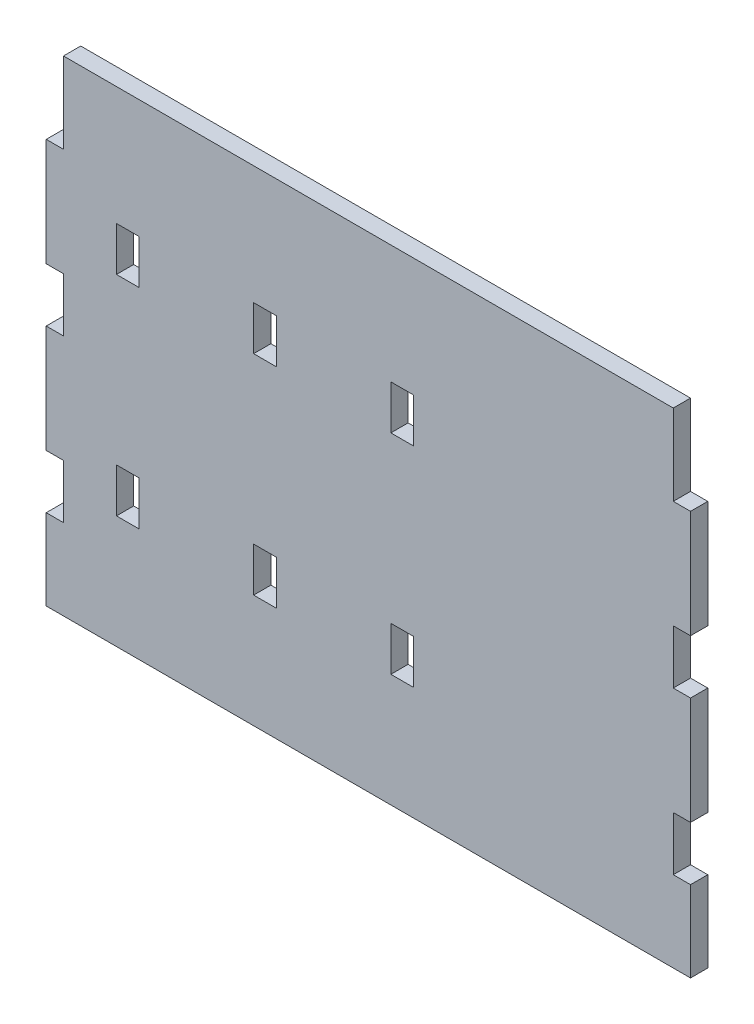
ISO-10303-21;
HEADER;
FILE_DESCRIPTION(('STEP AP214'),'2;1');
FILE_NAME('part.step','',(''),(''),'','','');
FILE_SCHEMA(('AUTOMOTIVE_DESIGN { 1 0 10303 214 1 1 1 1 }'));
ENDSEC;
DATA;
#1=APPLICATION_CONTEXT('core data for automotive mechanical design processes');
#2=APPLICATION_PROTOCOL_DEFINITION('international standard','automotive_design',2000,#1);
#3=PRODUCT_CONTEXT('',#1,'mechanical');
#4=PRODUCT('Part','Part','',(#3));
#5=PRODUCT_RELATED_PRODUCT_CATEGORY('part','',(#4));
#6=PRODUCT_DEFINITION_FORMATION('','',#4);
#7=PRODUCT_DEFINITION_CONTEXT('part definition',#1,'design');
#8=PRODUCT_DEFINITION('design','',#6,#7);
#9=PRODUCT_DEFINITION_SHAPE('','',#8);
#10=(LENGTH_UNIT() NAMED_UNIT(*) SI_UNIT(.MILLI.,.METRE.));
#11=(NAMED_UNIT(*) PLANE_ANGLE_UNIT() SI_UNIT($,.RADIAN.));
#12=(NAMED_UNIT(*) SI_UNIT($,.STERADIAN.) SOLID_ANGLE_UNIT());
#13=UNCERTAINTY_MEASURE_WITH_UNIT(LENGTH_MEASURE(1.E-05),#10,'distance_accuracy_value','');
#14=(GEOMETRIC_REPRESENTATION_CONTEXT(3) GLOBAL_UNCERTAINTY_ASSIGNED_CONTEXT((#13)) GLOBAL_UNIT_ASSIGNED_CONTEXT((#10,
#11,#12)) REPRESENTATION_CONTEXT('',''));
#15=CARTESIAN_POINT('',(0.,0.,0.));
#16=DIRECTION('',(0.,0.,1.));
#17=DIRECTION('',(1.,0.,0.));
#18=AXIS2_PLACEMENT_3D('',#15,#16,#17);
#19=CARTESIAN_POINT('',(0.,475.,16.));
#20=DIRECTION('',(0.,1.,0.));
#21=DIRECTION('',(0.,0.,1.));
#22=AXIS2_PLACEMENT_3D('',#19,#20,#21);
#23=PLANE('',#22);
#24=DIRECTION('',(1.,0.,0.));
#25=VECTOR('',#24,1.);
#26=CARTESIAN_POINT('',(0.,475.,0.));
#27=LINE('',#26,#25);
#28=CARTESIAN_POINT('',(565.8,475.,0.));
#29=VERTEX_POINT('',#28);
#30=CARTESIAN_POINT('',(581.8,475.,0.));
#31=VERTEX_POINT('',#30);
#32=EDGE_CURVE('E521',#29,#31,#27,.T.);
#33=ORIENTED_EDGE('',*,*,#32,.F.);
#34=DIRECTION('',(0.,0.,-1.));
#35=VECTOR('',#34,1.);
#36=CARTESIAN_POINT('',(565.8,475.,16.));
#37=LINE('',#36,#35);
#38=CARTESIAN_POINT('',(565.8,475.,16.));
#39=VERTEX_POINT('',#38);
#40=EDGE_CURVE('E11',#39,#29,#37,.T.);
#41=ORIENTED_EDGE('',*,*,#40,.F.);
#42=DIRECTION('',(1.,0.,0.));
#43=VECTOR('',#42,1.);
#44=CARTESIAN_POINT('',(0.,475.,16.));
#45=LINE('',#44,#43);
#46=CARTESIAN_POINT('',(581.8,475.,16.));
#47=VERTEX_POINT('',#46);
#48=EDGE_CURVE('E528',#39,#47,#45,.T.);
#49=ORIENTED_EDGE('',*,*,#48,.T.);
#50=DIRECTION('',(0.,0.,-1.));
#51=VECTOR('',#50,1.);
#52=CARTESIAN_POINT('',(581.8,475.,16.));
#53=LINE('',#52,#51);
#54=EDGE_CURVE('E583',#47,#31,#53,.T.);
#55=ORIENTED_EDGE('',*,*,#54,.T.);
#56=EDGE_LOOP('',(#33,#41,#49,#55));
#57=FACE_BOUND('',#56,.T.);
#58=ADVANCED_FACE('F36',(#57),#23,.T.);
#59=CARTESIAN_POINT('',(565.8,-1.66533453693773E-13,16.));
#60=DIRECTION('',(-1.,0.,0.));
#61=DIRECTION('',(0.,-1.,0.));
#62=AXIS2_PLACEMENT_3D('',#59,#60,#61);
#63=PLANE('',#62);
#64=DIRECTION('',(0.,1.,0.));
#65=VECTOR('',#64,1.);
#66=CARTESIAN_POINT('',(565.8,-1.66533453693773E-13,0.));
#67=LINE('',#66,#65);
#68=CARTESIAN_POINT('',(565.8,550.,0.));
#69=VERTEX_POINT('',#68);
#70=EDGE_CURVE('E586',#29,#69,#67,.T.);
#71=ORIENTED_EDGE('',*,*,#70,.T.);
#72=DIRECTION('',(0.,0.,-1.));
#73=VECTOR('',#72,1.);
#74=CARTESIAN_POINT('',(565.8,550.,16.));
#75=LINE('',#74,#73);
#76=CARTESIAN_POINT('',(565.8,550.,16.));
#77=VERTEX_POINT('',#76);
#78=EDGE_CURVE('E43',#77,#69,#75,.T.);
#79=ORIENTED_EDGE('',*,*,#78,.F.);
#80=DIRECTION('',(0.,1.,0.));
#81=VECTOR('',#80,1.);
#82=CARTESIAN_POINT('',(565.8,-1.66533453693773E-13,16.));
#83=LINE('',#82,#81);
#84=EDGE_CURVE('E531',#39,#77,#83,.T.);
#85=ORIENTED_EDGE('',*,*,#84,.F.);
#86=ORIENTED_EDGE('',*,*,#40,.T.);
#87=EDGE_LOOP('',(#71,#79,#85,#86));
#88=FACE_BOUND('',#87,.T.);
#89=ADVANCED_FACE('F698',(#88),#63,.F.);
#90=CARTESIAN_POINT('',(0.,550.,16.));
#91=DIRECTION('',(0.,1.,0.));
#92=DIRECTION('',(0.,0.,1.));
#93=AXIS2_PLACEMENT_3D('',#90,#91,#92);
#94=PLANE('',#93);
#95=DIRECTION('',(1.,0.,0.));
#96=VECTOR('',#95,1.);
#97=CARTESIAN_POINT('',(0.,550.,0.));
#98=LINE('',#97,#96);
#99=CARTESIAN_POINT('',(0.,550.,0.));
#100=VERTEX_POINT('',#99);
#101=EDGE_CURVE('E589',#100,#69,#98,.T.);
#102=ORIENTED_EDGE('',*,*,#101,.F.);
#103=DIRECTION('',(0.,0.,-1.));
#104=VECTOR('',#103,1.);
#105=CARTESIAN_POINT('',(0.,550.,16.));
#106=LINE('',#105,#104);
#107=CARTESIAN_POINT('',(0.,550.,16.));
#108=VERTEX_POINT('',#107);
#109=EDGE_CURVE('E689',#108,#100,#106,.T.);
#110=ORIENTED_EDGE('',*,*,#109,.F.);
#111=DIRECTION('',(1.,0.,0.));
#112=VECTOR('',#111,1.);
#113=CARTESIAN_POINT('',(0.,550.,16.));
#114=LINE('',#113,#112);
#115=EDGE_CURVE('E534',#108,#77,#114,.T.);
#116=ORIENTED_EDGE('',*,*,#115,.T.);
#117=ORIENTED_EDGE('',*,*,#78,.T.);
#118=EDGE_LOOP('',(#102,#110,#116,#117));
#119=FACE_BOUND('',#118,.T.);
#120=ADVANCED_FACE('F693',(#119),#94,.T.);
#121=CARTESIAN_POINT('',(0.,0.,16.));
#122=DIRECTION('',(-1.,0.,0.));
#123=DIRECTION('',(0.,-1.,0.));
#124=AXIS2_PLACEMENT_3D('',#121,#122,#123);
#125=PLANE('',#124);
#126=DIRECTION('',(0.,1.,0.));
#127=VECTOR('',#126,1.);
#128=CARTESIAN_POINT('',(0.,0.,0.));
#129=LINE('',#128,#127);
#130=CARTESIAN_POINT('',(0.,475.,0.));
#131=VERTEX_POINT('',#130);
#132=EDGE_CURVE('E594',#131,#100,#129,.T.);
#133=ORIENTED_EDGE('',*,*,#132,.F.);
#134=DIRECTION('',(0.,0.,-1.));
#135=VECTOR('',#134,1.);
#136=CARTESIAN_POINT('',(0.,475.,16.));
#137=LINE('',#136,#135);
#138=CARTESIAN_POINT('',(0.,475.,16.));
#139=VERTEX_POINT('',#138);
#140=EDGE_CURVE('E687',#139,#131,#137,.T.);
#141=ORIENTED_EDGE('',*,*,#140,.F.);
#142=DIRECTION('',(0.,1.,0.));
#143=VECTOR('',#142,1.);
#144=CARTESIAN_POINT('',(0.,0.,16.));
#145=LINE('',#144,#143);
#146=EDGE_CURVE('E539',#139,#108,#145,.T.);
#147=ORIENTED_EDGE('',*,*,#146,.T.);
#148=ORIENTED_EDGE('',*,*,#109,.T.);
#149=EDGE_LOOP('',(#133,#141,#147,#148));
#150=FACE_BOUND('',#149,.T.);
#151=ADVANCED_FACE('F705',(#150),#125,.T.);
#152=CARTESIAN_POINT('',(0.,475.,16.));
#153=DIRECTION('',(0.,-1.,0.));
#154=DIRECTION('',(0.,0.,-1.));
#155=AXIS2_PLACEMENT_3D('',#152,#153,#154);
#156=PLANE('',#155);
#157=DIRECTION('',(-1.,0.,0.));
#158=VECTOR('',#157,1.);
#159=CARTESIAN_POINT('',(0.,475.,0.));
#160=LINE('',#159,#158);
#161=CARTESIAN_POINT('',(-16.,475.,0.));
#162=VERTEX_POINT('',#161);
#163=EDGE_CURVE('E597',#131,#162,#160,.T.);
#164=ORIENTED_EDGE('',*,*,#163,.T.);
#165=DIRECTION('',(0.,0.,-1.));
#166=VECTOR('',#165,1.);
#167=CARTESIAN_POINT('',(-16.,475.,16.));
#168=LINE('',#167,#166);
#169=CARTESIAN_POINT('',(-16.,475.,16.));
#170=VERTEX_POINT('',#169);
#171=EDGE_CURVE('E685',#170,#162,#168,.T.);
#172=ORIENTED_EDGE('',*,*,#171,.F.);
#173=DIRECTION('',(-1.,0.,0.));
#174=VECTOR('',#173,1.);
#175=CARTESIAN_POINT('',(0.,475.,16.));
#176=LINE('',#175,#174);
#177=EDGE_CURVE('E542',#139,#170,#176,.T.);
#178=ORIENTED_EDGE('',*,*,#177,.F.);
#179=ORIENTED_EDGE('',*,*,#140,.T.);
#180=EDGE_LOOP('',(#164,#172,#178,#179));
#181=FACE_BOUND('',#180,.T.);
#182=ADVANCED_FACE('F789',(#181),#156,.F.);
#183=CARTESIAN_POINT('',(-16.,0.,16.));
#184=DIRECTION('',(-1.,0.,0.));
#185=DIRECTION('',(0.,0.,1.));
#186=AXIS2_PLACEMENT_3D('',#183,#184,#185);
#187=PLANE('',#186);
#188=DIRECTION('',(0.,1.,0.));
#189=VECTOR('',#188,1.);
#190=CARTESIAN_POINT('',(-16.,0.,0.));
#191=LINE('',#190,#189);
#192=CARTESIAN_POINT('',(-16.,375.,0.));
#193=VERTEX_POINT('',#192);
#194=EDGE_CURVE('E602',#193,#162,#191,.T.);
#195=ORIENTED_EDGE('',*,*,#194,.F.);
#196=DIRECTION('',(0.,0.,-1.));
#197=VECTOR('',#196,1.);
#198=CARTESIAN_POINT('',(-16.,375.,16.));
#199=LINE('',#198,#197);
#200=CARTESIAN_POINT('',(-16.,375.,16.));
#201=VERTEX_POINT('',#200);
#202=EDGE_CURVE('E683',#201,#193,#199,.T.);
#203=ORIENTED_EDGE('',*,*,#202,.F.);
#204=DIRECTION('',(0.,1.,0.));
#205=VECTOR('',#204,1.);
#206=CARTESIAN_POINT('',(-16.,0.,16.));
#207=LINE('',#206,#205);
#208=EDGE_CURVE('E546',#201,#170,#207,.T.);
#209=ORIENTED_EDGE('',*,*,#208,.T.);
#210=ORIENTED_EDGE('',*,*,#171,.T.);
#211=EDGE_LOOP('',(#195,#203,#209,#210));
#212=FACE_BOUND('',#211,.T.);
#213=ADVANCED_FACE('F786',(#212),#187,.T.);
#214=CARTESIAN_POINT('',(0.,375.,16.));
#215=DIRECTION('',(0.,-1.,0.));
#216=DIRECTION('',(0.,0.,-1.));
#217=AXIS2_PLACEMENT_3D('',#214,#215,#216);
#218=PLANE('',#217);
#219=DIRECTION('',(-1.,0.,0.));
#220=VECTOR('',#219,1.);
#221=CARTESIAN_POINT('',(0.,375.,0.));
#222=LINE('',#221,#220);
#223=CARTESIAN_POINT('',(0.,375.,0.));
#224=VERTEX_POINT('',#223);
#225=EDGE_CURVE('E605',#224,#193,#222,.T.);
#226=ORIENTED_EDGE('',*,*,#225,.F.);
#227=DIRECTION('',(0.,0.,-1.));
#228=VECTOR('',#227,1.);
#229=CARTESIAN_POINT('',(0.,375.,16.));
#230=LINE('',#229,#228);
#231=CARTESIAN_POINT('',(0.,375.,16.));
#232=VERTEX_POINT('',#231);
#233=EDGE_CURVE('E681',#232,#224,#230,.T.);
#234=ORIENTED_EDGE('',*,*,#233,.F.);
#235=DIRECTION('',(-1.,0.,0.));
#236=VECTOR('',#235,1.);
#237=CARTESIAN_POINT('',(0.,375.,16.));
#238=LINE('',#237,#236);
#239=EDGE_CURVE('E549',#232,#201,#238,.T.);
#240=ORIENTED_EDGE('',*,*,#239,.T.);
#241=ORIENTED_EDGE('',*,*,#202,.T.);
#242=EDGE_LOOP('',(#226,#234,#240,#241));
#243=FACE_BOUND('',#242,.T.);
#244=ADVANCED_FACE('F782',(#243),#218,.T.);
#245=CARTESIAN_POINT('',(0.,325.,0.));
#246=VERTEX_POINT('',#245);
#247=EDGE_CURVE('E599',#246,#224,#129,.T.);
#248=ORIENTED_EDGE('',*,*,#247,.F.);
#249=DIRECTION('',(0.,0.,-1.));
#250=VECTOR('',#249,1.);
#251=CARTESIAN_POINT('',(0.,325.,16.));
#252=LINE('',#251,#250);
#253=CARTESIAN_POINT('',(0.,325.,16.));
#254=VERTEX_POINT('',#253);
#255=EDGE_CURVE('E679',#254,#246,#252,.T.);
#256=ORIENTED_EDGE('',*,*,#255,.F.);
#257=EDGE_CURVE('E544',#254,#232,#145,.T.);
#258=ORIENTED_EDGE('',*,*,#257,.T.);
#259=ORIENTED_EDGE('',*,*,#233,.T.);
#260=EDGE_LOOP('',(#248,#256,#258,#259));
#261=FACE_BOUND('',#260,.T.);
#262=ADVANCED_FACE('F776',(#261),#125,.T.);
#263=CARTESIAN_POINT('',(0.,325.,16.));
#264=DIRECTION('',(0.,-1.,0.));
#265=DIRECTION('',(0.,0.,-1.));
#266=AXIS2_PLACEMENT_3D('',#263,#264,#265);
#267=PLANE('',#266);
#268=DIRECTION('',(-1.,0.,0.));
#269=VECTOR('',#268,1.);
#270=CARTESIAN_POINT('',(0.,325.,0.));
#271=LINE('',#270,#269);
#272=CARTESIAN_POINT('',(-16.,325.,0.));
#273=VERTEX_POINT('',#272);
#274=EDGE_CURVE('E608',#246,#273,#271,.T.);
#275=ORIENTED_EDGE('',*,*,#274,.T.);
#276=DIRECTION('',(0.,0.,-1.));
#277=VECTOR('',#276,1.);
#278=CARTESIAN_POINT('',(-16.,325.,16.));
#279=LINE('',#278,#277);
#280=CARTESIAN_POINT('',(-16.,325.,16.));
#281=VERTEX_POINT('',#280);
#282=EDGE_CURVE('E677',#281,#273,#279,.T.);
#283=ORIENTED_EDGE('',*,*,#282,.F.);
#284=DIRECTION('',(-1.,0.,0.));
#285=VECTOR('',#284,1.);
#286=CARTESIAN_POINT('',(0.,325.,16.));
#287=LINE('',#286,#285);
#288=EDGE_CURVE('E552',#254,#281,#287,.T.);
#289=ORIENTED_EDGE('',*,*,#288,.F.);
#290=ORIENTED_EDGE('',*,*,#255,.T.);
#291=EDGE_LOOP('',(#275,#283,#289,#290));
#292=FACE_BOUND('',#291,.T.);
#293=ADVANCED_FACE('F800',(#292),#267,.F.);
#294=CARTESIAN_POINT('',(-16.,0.,16.));
#295=DIRECTION('',(-1.,0.,0.));
#296=DIRECTION('',(0.,0.,1.));
#297=AXIS2_PLACEMENT_3D('',#294,#295,#296);
#298=PLANE('',#297);
#299=DIRECTION('',(0.,1.,0.));
#300=VECTOR('',#299,1.);
#301=CARTESIAN_POINT('',(-16.,0.,0.));
#302=LINE('',#301,#300);
#303=CARTESIAN_POINT('',(-16.,225.,0.));
#304=VERTEX_POINT('',#303);
#305=EDGE_CURVE('E611',#304,#273,#302,.T.);
#306=ORIENTED_EDGE('',*,*,#305,.F.);
#307=DIRECTION('',(0.,0.,-1.));
#308=VECTOR('',#307,1.);
#309=CARTESIAN_POINT('',(-16.,225.,16.));
#310=LINE('',#309,#308);
#311=CARTESIAN_POINT('',(-16.,225.,16.));
#312=VERTEX_POINT('',#311);
#313=EDGE_CURVE('E675',#312,#304,#310,.T.);
#314=ORIENTED_EDGE('',*,*,#313,.F.);
#315=DIRECTION('',(0.,1.,0.));
#316=VECTOR('',#315,1.);
#317=CARTESIAN_POINT('',(-16.,0.,16.));
#318=LINE('',#317,#316);
#319=EDGE_CURVE('E554',#312,#281,#318,.T.);
#320=ORIENTED_EDGE('',*,*,#319,.T.);
#321=ORIENTED_EDGE('',*,*,#282,.T.);
#322=EDGE_LOOP('',(#306,#314,#320,#321));
#323=FACE_BOUND('',#322,.T.);
#324=ADVANCED_FACE('F798',(#323),#298,.T.);
#325=CARTESIAN_POINT('',(0.,225.,16.));
#326=DIRECTION('',(0.,-1.,0.));
#327=DIRECTION('',(0.,0.,-1.));
#328=AXIS2_PLACEMENT_3D('',#325,#326,#327);
#329=PLANE('',#328);
#330=DIRECTION('',(-1.,0.,0.));
#331=VECTOR('',#330,1.);
#332=CARTESIAN_POINT('',(0.,225.,0.));
#333=LINE('',#332,#331);
#334=CARTESIAN_POINT('',(0.,225.,0.));
#335=VERTEX_POINT('',#334);
#336=EDGE_CURVE('E614',#335,#304,#333,.T.);
#337=ORIENTED_EDGE('',*,*,#336,.F.);
#338=DIRECTION('',(0.,0.,-1.));
#339=VECTOR('',#338,1.);
#340=CARTESIAN_POINT('',(0.,225.,16.));
#341=LINE('',#340,#339);
#342=CARTESIAN_POINT('',(0.,225.,16.));
#343=VERTEX_POINT('',#342);
#344=EDGE_CURVE('E673',#343,#335,#341,.T.);
#345=ORIENTED_EDGE('',*,*,#344,.F.);
#346=DIRECTION('',(-1.,0.,0.));
#347=VECTOR('',#346,1.);
#348=CARTESIAN_POINT('',(0.,225.,16.));
#349=LINE('',#348,#347);
#350=EDGE_CURVE('E557',#343,#312,#349,.T.);
#351=ORIENTED_EDGE('',*,*,#350,.T.);
#352=ORIENTED_EDGE('',*,*,#313,.T.);
#353=EDGE_LOOP('',(#337,#345,#351,#352));
#354=FACE_BOUND('',#353,.T.);
#355=ADVANCED_FACE('F795',(#354),#329,.T.);
#356=CARTESIAN_POINT('',(0.,175.,0.));
#357=VERTEX_POINT('',#356);
#358=EDGE_CURVE('E598',#357,#335,#129,.T.);
#359=ORIENTED_EDGE('',*,*,#358,.F.);
#360=DIRECTION('',(0.,0.,-1.));
#361=VECTOR('',#360,1.);
#362=CARTESIAN_POINT('',(0.,175.,16.));
#363=LINE('',#362,#361);
#364=CARTESIAN_POINT('',(0.,175.,16.));
#365=VERTEX_POINT('',#364);
#366=EDGE_CURVE('E671',#365,#357,#363,.T.);
#367=ORIENTED_EDGE('',*,*,#366,.F.);
#368=EDGE_CURVE('E543',#365,#343,#145,.T.);
#369=ORIENTED_EDGE('',*,*,#368,.T.);
#370=ORIENTED_EDGE('',*,*,#344,.T.);
#371=EDGE_LOOP('',(#359,#367,#369,#370));
#372=FACE_BOUND('',#371,.T.);
#373=ADVANCED_FACE('F767',(#372),#125,.T.);
#374=CARTESIAN_POINT('',(0.,175.,16.));
#375=DIRECTION('',(0.,-1.,0.));
#376=DIRECTION('',(0.,0.,-1.));
#377=AXIS2_PLACEMENT_3D('',#374,#375,#376);
#378=PLANE('',#377);
#379=DIRECTION('',(-1.,0.,0.));
#380=VECTOR('',#379,1.);
#381=CARTESIAN_POINT('',(0.,175.,0.));
#382=LINE('',#381,#380);
#383=CARTESIAN_POINT('',(-16.,175.,0.));
#384=VERTEX_POINT('',#383);
#385=EDGE_CURVE('E617',#357,#384,#382,.T.);
#386=ORIENTED_EDGE('',*,*,#385,.T.);
#387=DIRECTION('',(0.,0.,-1.));
#388=VECTOR('',#387,1.);
#389=CARTESIAN_POINT('',(-16.,175.,16.));
#390=LINE('',#389,#388);
#391=CARTESIAN_POINT('',(-16.,175.,16.));
#392=VERTEX_POINT('',#391);
#393=EDGE_CURVE('E668',#392,#384,#390,.T.);
#394=ORIENTED_EDGE('',*,*,#393,.F.);
#395=DIRECTION('',(-1.,0.,0.));
#396=VECTOR('',#395,1.);
#397=CARTESIAN_POINT('',(0.,175.,16.));
#398=LINE('',#397,#396);
#399=EDGE_CURVE('E560',#365,#392,#398,.T.);
#400=ORIENTED_EDGE('',*,*,#399,.F.);
#401=ORIENTED_EDGE('',*,*,#366,.T.);
#402=EDGE_LOOP('',(#386,#394,#400,#401));
#403=FACE_BOUND('',#402,.T.);
#404=ADVANCED_FACE('F843',(#403),#378,.F.);
#405=CARTESIAN_POINT('',(-16.,0.,16.));
#406=DIRECTION('',(1.,0.,0.));
#407=DIRECTION('',(0.,0.,-1.));
#408=AXIS2_PLACEMENT_3D('',#405,#406,#407);
#409=PLANE('',#408);
#410=DIRECTION('',(0.,-1.,0.));
#411=VECTOR('',#410,1.);
#412=CARTESIAN_POINT('',(-16.,0.,0.));
#413=LINE('',#412,#411);
#414=CARTESIAN_POINT('',(-16.,100.,0.));
#415=VERTEX_POINT('',#414);
#416=EDGE_CURVE('E619',#384,#415,#413,.T.);
#417=ORIENTED_EDGE('',*,*,#416,.T.);
#418=DIRECTION('',(0.,0.,-1.));
#419=VECTOR('',#418,1.);
#420=CARTESIAN_POINT('',(-16.,100.,16.));
#421=LINE('',#420,#419);
#422=CARTESIAN_POINT('',(-16.,100.,16.));
#423=VERTEX_POINT('',#422);
#424=EDGE_CURVE('E665',#423,#415,#421,.T.);
#425=ORIENTED_EDGE('',*,*,#424,.F.);
#426=DIRECTION('',(0.,-1.,0.));
#427=VECTOR('',#426,1.);
#428=CARTESIAN_POINT('',(-16.,0.,16.));
#429=LINE('',#428,#427);
#430=EDGE_CURVE('E562',#392,#423,#429,.T.);
#431=ORIENTED_EDGE('',*,*,#430,.F.);
#432=ORIENTED_EDGE('',*,*,#393,.T.);
#433=EDGE_LOOP('',(#417,#425,#431,#432));
#434=FACE_BOUND('',#433,.T.);
#435=ADVANCED_FACE('F760',(#434),#409,.F.);
#436=CARTESIAN_POINT('',(0.,100.,16.));
#437=DIRECTION('',(0.,1.,0.));
#438=DIRECTION('',(0.,0.,1.));
#439=AXIS2_PLACEMENT_3D('',#436,#437,#438);
#440=PLANE('',#439);
#441=DIRECTION('',(1.,0.,0.));
#442=VECTOR('',#441,1.);
#443=CARTESIAN_POINT('',(0.,100.,0.));
#444=LINE('',#443,#442);
#445=CARTESIAN_POINT('',(581.8,100.,0.));
#446=VERTEX_POINT('',#445);
#447=EDGE_CURVE('E621',#415,#446,#444,.T.);
#448=ORIENTED_EDGE('',*,*,#447,.T.);
#449=DIRECTION('',(0.,0.,-1.));
#450=VECTOR('',#449,1.);
#451=CARTESIAN_POINT('',(581.8,100.,16.));
#452=LINE('',#451,#450);
#453=CARTESIAN_POINT('',(581.8,100.,16.));
#454=VERTEX_POINT('',#453);
#455=EDGE_CURVE('E663',#454,#446,#452,.T.);
#456=ORIENTED_EDGE('',*,*,#455,.F.);
#457=DIRECTION('',(1.,0.,0.));
#458=VECTOR('',#457,1.);
#459=CARTESIAN_POINT('',(0.,100.,16.));
#460=LINE('',#459,#458);
#461=EDGE_CURVE('E564',#423,#454,#460,.T.);
#462=ORIENTED_EDGE('',*,*,#461,.F.);
#463=ORIENTED_EDGE('',*,*,#424,.T.);
#464=EDGE_LOOP('',(#448,#456,#462,#463));
#465=FACE_BOUND('',#464,.T.);
#466=ADVANCED_FACE('F756',(#465),#440,.F.);
#467=CARTESIAN_POINT('',(581.8,-8.88178419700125E-13,16.));
#468=DIRECTION('',(1.,0.,0.));
#469=DIRECTION('',(0.,1.,0.));
#470=AXIS2_PLACEMENT_3D('',#467,#468,#469);
#471=PLANE('',#470);
#472=DIRECTION('',(0.,-1.,0.));
#473=VECTOR('',#472,1.);
#474=CARTESIAN_POINT('',(581.8,-8.88178419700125E-13,0.));
#475=LINE('',#474,#473);
#476=CARTESIAN_POINT('',(581.8,175.,0.));
#477=VERTEX_POINT('',#476);
#478=EDGE_CURVE('E624',#477,#446,#475,.T.);
#479=ORIENTED_EDGE('',*,*,#478,.F.);
#480=DIRECTION('',(0.,0.,-1.));
#481=VECTOR('',#480,1.);
#482=CARTESIAN_POINT('',(581.8,175.,16.));
#483=LINE('',#482,#481);
#484=CARTESIAN_POINT('',(581.8,175.,16.));
#485=VERTEX_POINT('',#484);
#486=EDGE_CURVE('E661',#485,#477,#483,.T.);
#487=ORIENTED_EDGE('',*,*,#486,.F.);
#488=DIRECTION('',(0.,-1.,0.));
#489=VECTOR('',#488,1.);
#490=CARTESIAN_POINT('',(581.8,-8.88178419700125E-13,16.));
#491=LINE('',#490,#489);
#492=EDGE_CURVE('E566',#485,#454,#491,.T.);
#493=ORIENTED_EDGE('',*,*,#492,.T.);
#494=ORIENTED_EDGE('',*,*,#455,.T.);
#495=EDGE_LOOP('',(#479,#487,#493,#494));
#496=FACE_BOUND('',#495,.T.);
#497=ADVANCED_FACE('F752',(#496),#471,.T.);
#498=CARTESIAN_POINT('',(0.,175.,16.));
#499=DIRECTION('',(0.,1.,0.));
#500=DIRECTION('',(0.,0.,1.));
#501=AXIS2_PLACEMENT_3D('',#498,#499,#500);
#502=PLANE('',#501);
#503=DIRECTION('',(1.,0.,0.));
#504=VECTOR('',#503,1.);
#505=CARTESIAN_POINT('',(0.,175.,0.));
#506=LINE('',#505,#504);
#507=CARTESIAN_POINT('',(565.8,175.,0.));
#508=VERTEX_POINT('',#507);
#509=EDGE_CURVE('E627',#508,#477,#506,.T.);
#510=ORIENTED_EDGE('',*,*,#509,.F.);
#511=DIRECTION('',(0.,0.,-1.));
#512=VECTOR('',#511,1.);
#513=CARTESIAN_POINT('',(565.8,175.,16.));
#514=LINE('',#513,#512);
#515=CARTESIAN_POINT('',(565.8,175.,16.));
#516=VERTEX_POINT('',#515);
#517=EDGE_CURVE('E659',#516,#508,#514,.T.);
#518=ORIENTED_EDGE('',*,*,#517,.F.);
#519=DIRECTION('',(1.,0.,0.));
#520=VECTOR('',#519,1.);
#521=CARTESIAN_POINT('',(0.,175.,16.));
#522=LINE('',#521,#520);
#523=EDGE_CURVE('E569',#516,#485,#522,.T.);
#524=ORIENTED_EDGE('',*,*,#523,.T.);
#525=ORIENTED_EDGE('',*,*,#486,.T.);
#526=EDGE_LOOP('',(#510,#518,#524,#525));
#527=FACE_BOUND('',#526,.T.);
#528=ADVANCED_FACE('F747',(#527),#502,.T.);
#529=CARTESIAN_POINT('',(565.8,225.,0.));
#530=VERTEX_POINT('',#529);
#531=EDGE_CURVE('E591',#508,#530,#67,.T.);
#532=ORIENTED_EDGE('',*,*,#531,.T.);
#533=DIRECTION('',(0.,0.,-1.));
#534=VECTOR('',#533,1.);
#535=CARTESIAN_POINT('',(565.8,225.,16.));
#536=LINE('',#535,#534);
#537=CARTESIAN_POINT('',(565.8,225.,16.));
#538=VERTEX_POINT('',#537);
#539=EDGE_CURVE('E656',#538,#530,#536,.T.);
#540=ORIENTED_EDGE('',*,*,#539,.F.);
#541=EDGE_CURVE('E536',#516,#538,#83,.T.);
#542=ORIENTED_EDGE('',*,*,#541,.F.);
#543=ORIENTED_EDGE('',*,*,#517,.T.);
#544=EDGE_LOOP('',(#532,#540,#542,#543));
#545=FACE_BOUND('',#544,.T.);
#546=ADVANCED_FACE('F731',(#545),#63,.F.);
#547=CARTESIAN_POINT('',(0.,225.,16.));
#548=DIRECTION('',(0.,1.,0.));
#549=DIRECTION('',(0.,0.,1.));
#550=AXIS2_PLACEMENT_3D('',#547,#548,#549);
#551=PLANE('',#550);
#552=DIRECTION('',(1.,0.,0.));
#553=VECTOR('',#552,1.);
#554=CARTESIAN_POINT('',(0.,225.,0.));
#555=LINE('',#554,#553);
#556=CARTESIAN_POINT('',(581.8,225.,0.));
#557=VERTEX_POINT('',#556);
#558=EDGE_CURVE('E630',#530,#557,#555,.T.);
#559=ORIENTED_EDGE('',*,*,#558,.T.);
#560=DIRECTION('',(0.,0.,-1.));
#561=VECTOR('',#560,1.);
#562=CARTESIAN_POINT('',(581.8,225.,16.));
#563=LINE('',#562,#561);
#564=CARTESIAN_POINT('',(581.8,225.,16.));
#565=VERTEX_POINT('',#564);
#566=EDGE_CURVE('E653',#565,#557,#563,.T.);
#567=ORIENTED_EDGE('',*,*,#566,.F.);
#568=DIRECTION('',(1.,0.,0.));
#569=VECTOR('',#568,1.);
#570=CARTESIAN_POINT('',(0.,225.,16.));
#571=LINE('',#570,#569);
#572=EDGE_CURVE('E572',#538,#565,#571,.T.);
#573=ORIENTED_EDGE('',*,*,#572,.F.);
#574=ORIENTED_EDGE('',*,*,#539,.T.);
#575=EDGE_LOOP('',(#559,#567,#573,#574));
#576=FACE_BOUND('',#575,.T.);
#577=ADVANCED_FACE('F737',(#576),#551,.F.);
#578=CARTESIAN_POINT('',(581.8,0.,16.));
#579=DIRECTION('',(-1.,0.,0.));
#580=DIRECTION('',(0.,0.,1.));
#581=AXIS2_PLACEMENT_3D('',#578,#579,#580);
#582=PLANE('',#581);
#583=DIRECTION('',(0.,1.,0.));
#584=VECTOR('',#583,1.);
#585=CARTESIAN_POINT('',(581.8,0.,0.));
#586=LINE('',#585,#584);
#587=CARTESIAN_POINT('',(581.8,325.,0.));
#588=VERTEX_POINT('',#587);
#589=EDGE_CURVE('E632',#557,#588,#586,.T.);
#590=ORIENTED_EDGE('',*,*,#589,.T.);
#591=DIRECTION('',(0.,0.,-1.));
#592=VECTOR('',#591,1.);
#593=CARTESIAN_POINT('',(581.8,325.,16.));
#594=LINE('',#593,#592);
#595=CARTESIAN_POINT('',(581.8,325.,16.));
#596=VERTEX_POINT('',#595);
#597=EDGE_CURVE('E651',#596,#588,#594,.T.);
#598=ORIENTED_EDGE('',*,*,#597,.F.);
#599=DIRECTION('',(0.,1.,0.));
#600=VECTOR('',#599,1.);
#601=CARTESIAN_POINT('',(581.8,0.,16.));
#602=LINE('',#601,#600);
#603=EDGE_CURVE('E574',#565,#596,#602,.T.);
#604=ORIENTED_EDGE('',*,*,#603,.F.);
#605=ORIENTED_EDGE('',*,*,#566,.T.);
#606=EDGE_LOOP('',(#590,#598,#604,#605));
#607=FACE_BOUND('',#606,.T.);
#608=ADVANCED_FACE('F742',(#607),#582,.F.);
#609=CARTESIAN_POINT('',(0.,325.,16.));
#610=DIRECTION('',(0.,1.,0.));
#611=DIRECTION('',(0.,0.,1.));
#612=AXIS2_PLACEMENT_3D('',#609,#610,#611);
#613=PLANE('',#612);
#614=DIRECTION('',(1.,0.,0.));
#615=VECTOR('',#614,1.);
#616=CARTESIAN_POINT('',(0.,325.,0.));
#617=LINE('',#616,#615);
#618=CARTESIAN_POINT('',(565.8,325.,0.));
#619=VERTEX_POINT('',#618);
#620=EDGE_CURVE('E635',#619,#588,#617,.T.);
#621=ORIENTED_EDGE('',*,*,#620,.F.);
#622=DIRECTION('',(0.,0.,-1.));
#623=VECTOR('',#622,1.);
#624=CARTESIAN_POINT('',(565.8,325.,16.));
#625=LINE('',#624,#623);
#626=CARTESIAN_POINT('',(565.8,325.,16.));
#627=VERTEX_POINT('',#626);
#628=EDGE_CURVE('E649',#627,#619,#625,.T.);
#629=ORIENTED_EDGE('',*,*,#628,.F.);
#630=DIRECTION('',(1.,0.,0.));
#631=VECTOR('',#630,1.);
#632=CARTESIAN_POINT('',(0.,325.,16.));
#633=LINE('',#632,#631);
#634=EDGE_CURVE('E576',#627,#596,#633,.T.);
#635=ORIENTED_EDGE('',*,*,#634,.T.);
#636=ORIENTED_EDGE('',*,*,#597,.T.);
#637=EDGE_LOOP('',(#621,#629,#635,#636));
#638=FACE_BOUND('',#637,.T.);
#639=ADVANCED_FACE('F822',(#638),#613,.T.);
#640=CARTESIAN_POINT('',(565.8,375.,0.));
#641=VERTEX_POINT('',#640);
#642=EDGE_CURVE('E590',#619,#641,#67,.T.);
#643=ORIENTED_EDGE('',*,*,#642,.T.);
#644=DIRECTION('',(0.,0.,-1.));
#645=VECTOR('',#644,1.);
#646=CARTESIAN_POINT('',(565.8,375.,16.));
#647=LINE('',#646,#645);
#648=CARTESIAN_POINT('',(565.8,375.,16.));
#649=VERTEX_POINT('',#648);
#650=EDGE_CURVE('E646',#649,#641,#647,.T.);
#651=ORIENTED_EDGE('',*,*,#650,.F.);
#652=EDGE_CURVE('E535',#627,#649,#83,.T.);
#653=ORIENTED_EDGE('',*,*,#652,.F.);
#654=ORIENTED_EDGE('',*,*,#628,.T.);
#655=EDGE_LOOP('',(#643,#651,#653,#654));
#656=FACE_BOUND('',#655,.T.);
#657=ADVANCED_FACE('F725',(#656),#63,.F.);
#658=CARTESIAN_POINT('',(0.,375.,16.));
#659=DIRECTION('',(0.,1.,0.));
#660=DIRECTION('',(0.,0.,1.));
#661=AXIS2_PLACEMENT_3D('',#658,#659,#660);
#662=PLANE('',#661);
#663=DIRECTION('',(1.,0.,0.));
#664=VECTOR('',#663,1.);
#665=CARTESIAN_POINT('',(0.,375.,0.));
#666=LINE('',#665,#664);
#667=CARTESIAN_POINT('',(581.8,375.,0.));
#668=VERTEX_POINT('',#667);
#669=EDGE_CURVE('E638',#641,#668,#666,.T.);
#670=ORIENTED_EDGE('',*,*,#669,.T.);
#671=DIRECTION('',(0.,0.,-1.));
#672=VECTOR('',#671,1.);
#673=CARTESIAN_POINT('',(581.8,375.,16.));
#674=LINE('',#673,#672);
#675=CARTESIAN_POINT('',(581.8,375.,16.));
#676=VERTEX_POINT('',#675);
#677=EDGE_CURVE('E643',#676,#668,#674,.T.);
#678=ORIENTED_EDGE('',*,*,#677,.F.);
#679=DIRECTION('',(1.,0.,0.));
#680=VECTOR('',#679,1.);
#681=CARTESIAN_POINT('',(0.,375.,16.));
#682=LINE('',#681,#680);
#683=EDGE_CURVE('E579',#649,#676,#682,.T.);
#684=ORIENTED_EDGE('',*,*,#683,.F.);
#685=ORIENTED_EDGE('',*,*,#650,.T.);
#686=EDGE_LOOP('',(#670,#678,#684,#685));
#687=FACE_BOUND('',#686,.T.);
#688=ADVANCED_FACE('F721',(#687),#662,.F.);
#689=CARTESIAN_POINT('',(581.8,0.,16.));
#690=DIRECTION('',(-1.,0.,0.));
#691=DIRECTION('',(0.,0.,1.));
#692=AXIS2_PLACEMENT_3D('',#689,#690,#691);
#693=PLANE('',#692);
#694=DIRECTION('',(0.,1.,0.));
#695=VECTOR('',#694,1.);
#696=CARTESIAN_POINT('',(581.8,0.,0.));
#697=LINE('',#696,#695);
#698=EDGE_CURVE('E532',#668,#31,#697,.T.);
#699=ORIENTED_EDGE('',*,*,#698,.T.);
#700=ORIENTED_EDGE('',*,*,#54,.F.);
#701=DIRECTION('',(0.,1.,0.));
#702=VECTOR('',#701,1.);
#703=CARTESIAN_POINT('',(581.8,0.,16.));
#704=LINE('',#703,#702);
#705=EDGE_CURVE('E581',#676,#47,#704,.T.);
#706=ORIENTED_EDGE('',*,*,#705,.F.);
#707=ORIENTED_EDGE('',*,*,#677,.T.);
#708=EDGE_LOOP('',(#699,#700,#706,#707));
#709=FACE_BOUND('',#708,.T.);
#710=ADVANCED_FACE('F717',(#709),#693,.F.);
#711=CARTESIAN_POINT('',(0.,0.,16.));
#712=DIRECTION('',(0.,0.,1.));
#713=DIRECTION('',(1.,0.,0.));
#714=AXIS2_PLACEMENT_3D('',#711,#712,#713);
#715=PLANE('',#714);
#716=DIRECTION('',(1.,0.,0.));
#717=VECTOR('',#716,1.);
#718=CARTESIAN_POINT('',(0.,399.,16.));
#719=LINE('',#718,#717);
#720=CARTESIAN_POINT('',(176.45,399.,16.));
#721=VERTEX_POINT('',#720);
#722=CARTESIAN_POINT('',(197.45,399.,16.));
#723=VERTEX_POINT('',#722);
#724=EDGE_CURVE('E50',#721,#723,#719,.T.);
#725=ORIENTED_EDGE('',*,*,#724,.F.);
#726=DIRECTION('',(0.,1.,0.));
#727=VECTOR('',#726,1.);
#728=CARTESIAN_POINT('',(176.45,0.,16.));
#729=LINE('',#728,#727);
#730=CARTESIAN_POINT('',(176.45,440.,16.));
#731=VERTEX_POINT('',#730);
#732=EDGE_CURVE('E347',#721,#731,#729,.T.);
#733=ORIENTED_EDGE('',*,*,#732,.T.);
#734=DIRECTION('',(1.,0.,0.));
#735=VECTOR('',#734,1.);
#736=CARTESIAN_POINT('',(0.,440.,16.));
#737=LINE('',#736,#735);
#738=CARTESIAN_POINT('',(197.45,440.,16.));
#739=VERTEX_POINT('',#738);
#740=EDGE_CURVE('E353',#731,#739,#737,.T.);
#741=ORIENTED_EDGE('',*,*,#740,.T.);
#742=DIRECTION('',(0.,1.,0.));
#743=VECTOR('',#742,1.);
#744=CARTESIAN_POINT('',(197.45,0.,16.));
#745=LINE('',#744,#743);
#746=EDGE_CURVE('E359',#723,#739,#745,.T.);
#747=ORIENTED_EDGE('',*,*,#746,.F.);
#748=EDGE_LOOP('',(#725,#733,#741,#747));
#749=FACE_BOUND('',#748,.T.);
#750=DIRECTION('',(1.,0.,0.));
#751=VECTOR('',#750,1.);
#752=CARTESIAN_POINT('',(0.,399.,16.));
#753=LINE('',#752,#751);
#754=CARTESIAN_POINT('',(303.75,399.,16.));
#755=VERTEX_POINT('',#754);
#756=CARTESIAN_POINT('',(324.75,399.,16.));
#757=VERTEX_POINT('',#756);
#758=EDGE_CURVE('E58',#755,#757,#753,.T.);
#759=ORIENTED_EDGE('',*,*,#758,.F.);
#760=DIRECTION('',(0.,1.,0.));
#761=VECTOR('',#760,1.);
#762=CARTESIAN_POINT('',(303.75,0.,16.));
#763=LINE('',#762,#761);
#764=CARTESIAN_POINT('',(303.75,440.,16.));
#765=VERTEX_POINT('',#764);
#766=EDGE_CURVE('E387',#755,#765,#763,.T.);
#767=ORIENTED_EDGE('',*,*,#766,.T.);
#768=DIRECTION('',(1.,0.,0.));
#769=VECTOR('',#768,1.);
#770=CARTESIAN_POINT('',(0.,440.,16.));
#771=LINE('',#770,#769);
#772=CARTESIAN_POINT('',(324.75,440.,16.));
#773=VERTEX_POINT('',#772);
#774=EDGE_CURVE('E390',#765,#773,#771,.T.);
#775=ORIENTED_EDGE('',*,*,#774,.T.);
#776=DIRECTION('',(0.,1.,0.));
#777=VECTOR('',#776,1.);
#778=CARTESIAN_POINT('',(324.75,0.,16.));
#779=LINE('',#778,#777);
#780=EDGE_CURVE('E394',#757,#773,#779,.T.);
#781=ORIENTED_EDGE('',*,*,#780,.F.);
#782=EDGE_LOOP('',(#759,#767,#775,#781));
#783=FACE_BOUND('',#782,.T.);
#784=DIRECTION('',(1.,0.,0.));
#785=VECTOR('',#784,1.);
#786=CARTESIAN_POINT('',(49.1500000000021,205.,16.));
#787=LINE('',#786,#785);
#788=CARTESIAN_POINT('',(49.1500000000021,205.,16.));
#789=VERTEX_POINT('',#788);
#790=CARTESIAN_POINT('',(70.150000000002,205.,16.));
#791=VERTEX_POINT('',#790);
#792=EDGE_CURVE('E417',#789,#791,#787,.T.);
#793=ORIENTED_EDGE('',*,*,#792,.F.);
#794=DIRECTION('',(0.,1.,0.));
#795=VECTOR('',#794,1.);
#796=CARTESIAN_POINT('',(49.1500000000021,205.,16.));
#797=LINE('',#796,#795);
#798=CARTESIAN_POINT('',(49.1500000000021,246.,16.));
#799=VERTEX_POINT('',#798);
#800=EDGE_CURVE('E450',#789,#799,#797,.T.);
#801=ORIENTED_EDGE('',*,*,#800,.T.);
#802=DIRECTION('',(1.,0.,0.));
#803=VECTOR('',#802,1.);
#804=CARTESIAN_POINT('',(49.1500000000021,246.,16.));
#805=LINE('',#804,#803);
#806=CARTESIAN_POINT('',(70.150000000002,246.,16.));
#807=VERTEX_POINT('',#806);
#808=EDGE_CURVE('E453',#799,#807,#805,.T.);
#809=ORIENTED_EDGE('',*,*,#808,.T.);
#810=DIRECTION('',(0.,1.,0.));
#811=VECTOR('',#810,1.);
#812=CARTESIAN_POINT('',(70.150000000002,205.,16.));
#813=LINE('',#812,#811);
#814=EDGE_CURVE('E457',#791,#807,#813,.T.);
#815=ORIENTED_EDGE('',*,*,#814,.F.);
#816=EDGE_LOOP('',(#793,#801,#809,#815));
#817=FACE_BOUND('',#816,.T.);
#818=DIRECTION('',(1.,0.,0.));
#819=VECTOR('',#818,1.);
#820=CARTESIAN_POINT('',(0.,205.,16.));
#821=LINE('',#820,#819);
#822=CARTESIAN_POINT('',(303.750000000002,205.,16.));
#823=VERTEX_POINT('',#822);
#824=CARTESIAN_POINT('',(324.750000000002,205.,16.));
#825=VERTEX_POINT('',#824);
#826=EDGE_CURVE('E428',#823,#825,#821,.T.);
#827=ORIENTED_EDGE('',*,*,#826,.F.);
#828=DIRECTION('',(0.,1.,0.));
#829=VECTOR('',#828,1.);
#830=CARTESIAN_POINT('',(303.750000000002,0.,16.));
#831=LINE('',#830,#829);
#832=CARTESIAN_POINT('',(303.750000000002,246.,16.));
#833=VERTEX_POINT('',#832);
#834=EDGE_CURVE('E418',#823,#833,#831,.T.);
#835=ORIENTED_EDGE('',*,*,#834,.T.);
#836=DIRECTION('',(1.,0.,0.));
#837=VECTOR('',#836,1.);
#838=CARTESIAN_POINT('',(0.,246.,16.));
#839=LINE('',#838,#837);
#840=CARTESIAN_POINT('',(324.750000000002,246.,16.));
#841=VERTEX_POINT('',#840);
#842=EDGE_CURVE('E421',#833,#841,#839,.T.);
#843=ORIENTED_EDGE('',*,*,#842,.T.);
#844=DIRECTION('',(0.,1.,0.));
#845=VECTOR('',#844,1.);
#846=CARTESIAN_POINT('',(324.750000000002,0.,16.));
#847=LINE('',#846,#845);
#848=EDGE_CURVE('E425',#825,#841,#847,.T.);
#849=ORIENTED_EDGE('',*,*,#848,.F.);
#850=EDGE_LOOP('',(#827,#835,#843,#849));
#851=FACE_BOUND('',#850,.T.);
#852=DIRECTION('',(1.,0.,0.));
#853=VECTOR('',#852,1.);
#854=CARTESIAN_POINT('',(0.,205.,16.));
#855=LINE('',#854,#853);
#856=CARTESIAN_POINT('',(176.450000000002,205.,16.));
#857=VERTEX_POINT('',#856);
#858=CARTESIAN_POINT('',(197.450000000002,205.,16.));
#859=VERTEX_POINT('',#858);
#860=EDGE_CURVE('E386',#857,#859,#855,.T.);
#861=ORIENTED_EDGE('',*,*,#860,.F.);
#862=DIRECTION('',(0.,1.,0.));
#863=VECTOR('',#862,1.);
#864=CARTESIAN_POINT('',(176.450000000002,0.,16.));
#865=LINE('',#864,#863);
#866=CARTESIAN_POINT('',(176.450000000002,246.,16.));
#867=VERTEX_POINT('',#866);
#868=EDGE_CURVE('E479',#857,#867,#865,.T.);
#869=ORIENTED_EDGE('',*,*,#868,.T.);
#870=DIRECTION('',(1.,0.,0.));
#871=VECTOR('',#870,1.);
#872=CARTESIAN_POINT('',(0.,246.,16.));
#873=LINE('',#872,#871);
#874=CARTESIAN_POINT('',(197.450000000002,246.,16.));
#875=VERTEX_POINT('',#874);
#876=EDGE_CURVE('E482',#867,#875,#873,.T.);
#877=ORIENTED_EDGE('',*,*,#876,.T.);
#878=DIRECTION('',(0.,1.,0.));
#879=VECTOR('',#878,1.);
#880=CARTESIAN_POINT('',(197.450000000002,0.,16.));
#881=LINE('',#880,#879);
#882=EDGE_CURVE('E486',#859,#875,#881,.T.);
#883=ORIENTED_EDGE('',*,*,#882,.F.);
#884=EDGE_LOOP('',(#861,#869,#877,#883));
#885=FACE_BOUND('',#884,.T.);
#886=DIRECTION('',(1.,0.,0.));
#887=VECTOR('',#886,1.);
#888=CARTESIAN_POINT('',(0.,399.,16.));
#889=LINE('',#888,#887);
#890=CARTESIAN_POINT('',(49.15,399.,16.));
#891=VERTEX_POINT('',#890);
#892=CARTESIAN_POINT('',(70.15,399.,16.));
#893=VERTEX_POINT('',#892);
#894=EDGE_CURVE('E360',#891,#893,#889,.T.);
#895=ORIENTED_EDGE('',*,*,#894,.F.);
#896=DIRECTION('',(0.,1.,0.));
#897=VECTOR('',#896,1.);
#898=CARTESIAN_POINT('',(49.15,0.,16.));
#899=LINE('',#898,#897);
#900=CARTESIAN_POINT('',(49.15,440.,16.));
#901=VERTEX_POINT('',#900);
#902=EDGE_CURVE('E503',#891,#901,#899,.T.);
#903=ORIENTED_EDGE('',*,*,#902,.T.);
#904=DIRECTION('',(1.,0.,0.));
#905=VECTOR('',#904,1.);
#906=CARTESIAN_POINT('',(0.,440.,16.));
#907=LINE('',#906,#905);
#908=CARTESIAN_POINT('',(70.15,440.,16.));
#909=VERTEX_POINT('',#908);
#910=EDGE_CURVE('E514',#901,#909,#907,.T.);
#911=ORIENTED_EDGE('',*,*,#910,.T.);
#912=DIRECTION('',(0.,1.,0.));
#913=VECTOR('',#912,1.);
#914=CARTESIAN_POINT('',(70.15,0.,16.));
#915=LINE('',#914,#913);
#916=EDGE_CURVE('E362',#893,#909,#915,.T.);
#917=ORIENTED_EDGE('',*,*,#916,.F.);
#918=EDGE_LOOP('',(#895,#903,#911,#917));
#919=FACE_BOUND('',#918,.T.);
#920=ORIENTED_EDGE('',*,*,#48,.F.);
#921=ORIENTED_EDGE('',*,*,#84,.T.);
#922=ORIENTED_EDGE('',*,*,#115,.F.);
#923=ORIENTED_EDGE('',*,*,#146,.F.);
#924=ORIENTED_EDGE('',*,*,#177,.T.);
#925=ORIENTED_EDGE('',*,*,#208,.F.);
#926=ORIENTED_EDGE('',*,*,#239,.F.);
#927=ORIENTED_EDGE('',*,*,#257,.F.);
#928=ORIENTED_EDGE('',*,*,#288,.T.);
#929=ORIENTED_EDGE('',*,*,#319,.F.);
#930=ORIENTED_EDGE('',*,*,#350,.F.);
#931=ORIENTED_EDGE('',*,*,#368,.F.);
#932=ORIENTED_EDGE('',*,*,#399,.T.);
#933=ORIENTED_EDGE('',*,*,#430,.T.);
#934=ORIENTED_EDGE('',*,*,#461,.T.);
#935=ORIENTED_EDGE('',*,*,#492,.F.);
#936=ORIENTED_EDGE('',*,*,#523,.F.);
#937=ORIENTED_EDGE('',*,*,#541,.T.);
#938=ORIENTED_EDGE('',*,*,#572,.T.);
#939=ORIENTED_EDGE('',*,*,#603,.T.);
#940=ORIENTED_EDGE('',*,*,#634,.F.);
#941=ORIENTED_EDGE('',*,*,#652,.T.);
#942=ORIENTED_EDGE('',*,*,#683,.T.);
#943=ORIENTED_EDGE('',*,*,#705,.T.);
#944=EDGE_LOOP('',(#920,#921,#922,#923,#924,#925,#926,#927,#928,#929,#930,#931,#932,#933,#934,
#935,#936,#937,#938,#939,#940,#941,#942,#943));
#945=FACE_BOUND('',#944,.T.);
#946=ADVANCED_FACE('F356',(#749,#783,#817,#851,#885,#919,#945),#715,.T.);
#947=CARTESIAN_POINT('',(0.,0.,0.));
#948=DIRECTION('',(0.,0.,1.));
#949=DIRECTION('',(1.,0.,0.));
#950=AXIS2_PLACEMENT_3D('',#947,#948,#949);
#951=PLANE('',#950);
#952=DIRECTION('',(0.,1.,0.));
#953=VECTOR('',#952,1.);
#954=CARTESIAN_POINT('',(176.45,0.,0.));
#955=LINE('',#954,#953);
#956=CARTESIAN_POINT('',(176.45,399.,0.));
#957=VERTEX_POINT('',#956);
#958=CARTESIAN_POINT('',(176.45,440.,0.));
#959=VERTEX_POINT('',#958);
#960=EDGE_CURVE('E367',#957,#959,#955,.T.);
#961=ORIENTED_EDGE('',*,*,#960,.F.);
#962=DIRECTION('',(1.,0.,0.));
#963=VECTOR('',#962,1.);
#964=CARTESIAN_POINT('',(0.,399.,0.));
#965=LINE('',#964,#963);
#966=CARTESIAN_POINT('',(197.45,399.,0.));
#967=VERTEX_POINT('',#966);
#968=EDGE_CURVE('E341',#957,#967,#965,.T.);
#969=ORIENTED_EDGE('',*,*,#968,.T.);
#970=DIRECTION('',(0.,1.,0.));
#971=VECTOR('',#970,1.);
#972=CARTESIAN_POINT('',(197.45,0.,0.));
#973=LINE('',#972,#971);
#974=CARTESIAN_POINT('',(197.45,440.,0.));
#975=VERTEX_POINT('',#974);
#976=EDGE_CURVE('E373',#967,#975,#973,.T.);
#977=ORIENTED_EDGE('',*,*,#976,.T.);
#978=DIRECTION('',(1.,0.,0.));
#979=VECTOR('',#978,1.);
#980=CARTESIAN_POINT('',(0.,440.,0.));
#981=LINE('',#980,#979);
#982=EDGE_CURVE('E369',#959,#975,#981,.T.);
#983=ORIENTED_EDGE('',*,*,#982,.F.);
#984=EDGE_LOOP('',(#961,#969,#977,#983));
#985=FACE_BOUND('',#984,.T.);
#986=DIRECTION('',(0.,1.,0.));
#987=VECTOR('',#986,1.);
#988=CARTESIAN_POINT('',(303.75,0.,0.));
#989=LINE('',#988,#987);
#990=CARTESIAN_POINT('',(303.75,399.,0.));
#991=VERTEX_POINT('',#990);
#992=CARTESIAN_POINT('',(303.75,440.,0.));
#993=VERTEX_POINT('',#992);
#994=EDGE_CURVE('E379',#991,#993,#989,.T.);
#995=ORIENTED_EDGE('',*,*,#994,.F.);
#996=DIRECTION('',(1.,0.,0.));
#997=VECTOR('',#996,1.);
#998=CARTESIAN_POINT('',(0.,399.,0.));
#999=LINE('',#998,#997);
#1000=CARTESIAN_POINT('',(324.75,399.,0.));
#1001=VERTEX_POINT('',#1000);
#1002=EDGE_CURVE('E391',#991,#1001,#999,.T.);
#1003=ORIENTED_EDGE('',*,*,#1002,.T.);
#1004=DIRECTION('',(0.,1.,0.));
#1005=VECTOR('',#1004,1.);
#1006=CARTESIAN_POINT('',(324.75,0.,0.));
#1007=LINE('',#1006,#1005);
#1008=CARTESIAN_POINT('',(324.75,440.,0.));
#1009=VERTEX_POINT('',#1008);
#1010=EDGE_CURVE('E402',#1001,#1009,#1007,.T.);
#1011=ORIENTED_EDGE('',*,*,#1010,.T.);
#1012=DIRECTION('',(1.,0.,0.));
#1013=VECTOR('',#1012,1.);
#1014=CARTESIAN_POINT('',(0.,440.,0.));
#1015=LINE('',#1014,#1013);
#1016=EDGE_CURVE('E399',#993,#1009,#1015,.T.);
#1017=ORIENTED_EDGE('',*,*,#1016,.F.);
#1018=EDGE_LOOP('',(#995,#1003,#1011,#1017));
#1019=FACE_BOUND('',#1018,.T.);
#1020=DIRECTION('',(0.,1.,0.));
#1021=VECTOR('',#1020,1.);
#1022=CARTESIAN_POINT('',(49.1500000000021,205.,0.));
#1023=LINE('',#1022,#1021);
#1024=CARTESIAN_POINT('',(49.1500000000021,205.,0.));
#1025=VERTEX_POINT('',#1024);
#1026=CARTESIAN_POINT('',(49.1500000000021,246.,0.));
#1027=VERTEX_POINT('',#1026);
#1028=EDGE_CURVE('E443',#1025,#1027,#1023,.T.);
#1029=ORIENTED_EDGE('',*,*,#1028,.F.);
#1030=DIRECTION('',(1.,0.,0.));
#1031=VECTOR('',#1030,1.);
#1032=CARTESIAN_POINT('',(49.1500000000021,205.,0.));
#1033=LINE('',#1032,#1031);
#1034=CARTESIAN_POINT('',(70.150000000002,205.,0.));
#1035=VERTEX_POINT('',#1034);
#1036=EDGE_CURVE('E454',#1025,#1035,#1033,.T.);
#1037=ORIENTED_EDGE('',*,*,#1036,.T.);
#1038=DIRECTION('',(0.,1.,0.));
#1039=VECTOR('',#1038,1.);
#1040=CARTESIAN_POINT('',(70.150000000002,205.,0.));
#1041=LINE('',#1040,#1039);
#1042=CARTESIAN_POINT('',(70.150000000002,246.,0.));
#1043=VERTEX_POINT('',#1042);
#1044=EDGE_CURVE('E465',#1035,#1043,#1041,.T.);
#1045=ORIENTED_EDGE('',*,*,#1044,.T.);
#1046=DIRECTION('',(1.,0.,0.));
#1047=VECTOR('',#1046,1.);
#1048=CARTESIAN_POINT('',(49.1500000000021,246.,0.));
#1049=LINE('',#1048,#1047);
#1050=EDGE_CURVE('E462',#1027,#1043,#1049,.T.);
#1051=ORIENTED_EDGE('',*,*,#1050,.F.);
#1052=EDGE_LOOP('',(#1029,#1037,#1045,#1051));
#1053=FACE_BOUND('',#1052,.T.);
#1054=DIRECTION('',(0.,1.,0.));
#1055=VECTOR('',#1054,1.);
#1056=CARTESIAN_POINT('',(303.750000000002,0.,0.));
#1057=LINE('',#1056,#1055);
#1058=CARTESIAN_POINT('',(303.750000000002,205.,0.));
#1059=VERTEX_POINT('',#1058);
#1060=CARTESIAN_POINT('',(303.750000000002,246.,0.));
#1061=VERTEX_POINT('',#1060);
#1062=EDGE_CURVE('E410',#1059,#1061,#1057,.T.);
#1063=ORIENTED_EDGE('',*,*,#1062,.F.);
#1064=DIRECTION('',(1.,0.,0.));
#1065=VECTOR('',#1064,1.);
#1066=CARTESIAN_POINT('',(0.,205.,0.));
#1067=LINE('',#1066,#1065);
#1068=CARTESIAN_POINT('',(324.750000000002,205.,0.));
#1069=VERTEX_POINT('',#1068);
#1070=EDGE_CURVE('E422',#1059,#1069,#1067,.T.);
#1071=ORIENTED_EDGE('',*,*,#1070,.T.);
#1072=DIRECTION('',(0.,1.,0.));
#1073=VECTOR('',#1072,1.);
#1074=CARTESIAN_POINT('',(324.750000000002,0.,0.));
#1075=LINE('',#1074,#1073);
#1076=CARTESIAN_POINT('',(324.750000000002,246.,0.));
#1077=VERTEX_POINT('',#1076);
#1078=EDGE_CURVE('E435',#1069,#1077,#1075,.T.);
#1079=ORIENTED_EDGE('',*,*,#1078,.T.);
#1080=DIRECTION('',(1.,0.,0.));
#1081=VECTOR('',#1080,1.);
#1082=CARTESIAN_POINT('',(0.,246.,0.));
#1083=LINE('',#1082,#1081);
#1084=EDGE_CURVE('E432',#1061,#1077,#1083,.T.);
#1085=ORIENTED_EDGE('',*,*,#1084,.F.);
#1086=EDGE_LOOP('',(#1063,#1071,#1079,#1085));
#1087=FACE_BOUND('',#1086,.T.);
#1088=DIRECTION('',(0.,1.,0.));
#1089=VECTOR('',#1088,1.);
#1090=CARTESIAN_POINT('',(176.450000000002,0.,0.));
#1091=LINE('',#1090,#1089);
#1092=CARTESIAN_POINT('',(176.450000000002,205.,0.));
#1093=VERTEX_POINT('',#1092);
#1094=CARTESIAN_POINT('',(176.450000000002,246.,0.));
#1095=VERTEX_POINT('',#1094);
#1096=EDGE_CURVE('E473',#1093,#1095,#1091,.T.);
#1097=ORIENTED_EDGE('',*,*,#1096,.F.);
#1098=DIRECTION('',(1.,0.,0.));
#1099=VECTOR('',#1098,1.);
#1100=CARTESIAN_POINT('',(0.,205.,0.));
#1101=LINE('',#1100,#1099);
#1102=CARTESIAN_POINT('',(197.450000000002,205.,0.));
#1103=VERTEX_POINT('',#1102);
#1104=EDGE_CURVE('E483',#1093,#1103,#1101,.T.);
#1105=ORIENTED_EDGE('',*,*,#1104,.T.);
#1106=DIRECTION('',(0.,1.,0.));
#1107=VECTOR('',#1106,1.);
#1108=CARTESIAN_POINT('',(197.450000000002,0.,0.));
#1109=LINE('',#1108,#1107);
#1110=CARTESIAN_POINT('',(197.450000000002,246.,0.));
#1111=VERTEX_POINT('',#1110);
#1112=EDGE_CURVE('E494',#1103,#1111,#1109,.T.);
#1113=ORIENTED_EDGE('',*,*,#1112,.T.);
#1114=DIRECTION('',(1.,0.,0.));
#1115=VECTOR('',#1114,1.);
#1116=CARTESIAN_POINT('',(0.,246.,0.));
#1117=LINE('',#1116,#1115);
#1118=EDGE_CURVE('E491',#1095,#1111,#1117,.T.);
#1119=ORIENTED_EDGE('',*,*,#1118,.F.);
#1120=EDGE_LOOP('',(#1097,#1105,#1113,#1119));
#1121=FACE_BOUND('',#1120,.T.);
#1122=DIRECTION('',(0.,1.,0.));
#1123=VECTOR('',#1122,1.);
#1124=CARTESIAN_POINT('',(49.15,0.,0.));
#1125=LINE('',#1124,#1123);
#1126=CARTESIAN_POINT('',(49.15,399.,0.));
#1127=VERTEX_POINT('',#1126);
#1128=CARTESIAN_POINT('',(49.15,440.,0.));
#1129=VERTEX_POINT('',#1128);
#1130=EDGE_CURVE('E509',#1127,#1129,#1125,.T.);
#1131=ORIENTED_EDGE('',*,*,#1130,.F.);
#1132=DIRECTION('',(1.,0.,0.));
#1133=VECTOR('',#1132,1.);
#1134=CARTESIAN_POINT('',(0.,399.,0.));
#1135=LINE('',#1134,#1133);
#1136=CARTESIAN_POINT('',(70.15,399.,0.));
#1137=VERTEX_POINT('',#1136);
#1138=EDGE_CURVE('E499',#1127,#1137,#1135,.T.);
#1139=ORIENTED_EDGE('',*,*,#1138,.T.);
#1140=DIRECTION('',(0.,1.,0.));
#1141=VECTOR('',#1140,1.);
#1142=CARTESIAN_POINT('',(70.15,0.,0.));
#1143=LINE('',#1142,#1141);
#1144=CARTESIAN_POINT('',(70.15,440.,0.));
#1145=VERTEX_POINT('',#1144);
#1146=EDGE_CURVE('E502',#1137,#1145,#1143,.T.);
#1147=ORIENTED_EDGE('',*,*,#1146,.T.);
#1148=DIRECTION('',(1.,0.,0.));
#1149=VECTOR('',#1148,1.);
#1150=CARTESIAN_POINT('',(0.,440.,0.));
#1151=LINE('',#1150,#1149);
#1152=EDGE_CURVE('E506',#1129,#1145,#1151,.T.);
#1153=ORIENTED_EDGE('',*,*,#1152,.F.);
#1154=EDGE_LOOP('',(#1131,#1139,#1147,#1153));
#1155=FACE_BOUND('',#1154,.T.);
#1156=ORIENTED_EDGE('',*,*,#32,.T.);
#1157=ORIENTED_EDGE('',*,*,#698,.F.);
#1158=ORIENTED_EDGE('',*,*,#669,.F.);
#1159=ORIENTED_EDGE('',*,*,#642,.F.);
#1160=ORIENTED_EDGE('',*,*,#620,.T.);
#1161=ORIENTED_EDGE('',*,*,#589,.F.);
#1162=ORIENTED_EDGE('',*,*,#558,.F.);
#1163=ORIENTED_EDGE('',*,*,#531,.F.);
#1164=ORIENTED_EDGE('',*,*,#509,.T.);
#1165=ORIENTED_EDGE('',*,*,#478,.T.);
#1166=ORIENTED_EDGE('',*,*,#447,.F.);
#1167=ORIENTED_EDGE('',*,*,#416,.F.);
#1168=ORIENTED_EDGE('',*,*,#385,.F.);
#1169=ORIENTED_EDGE('',*,*,#358,.T.);
#1170=ORIENTED_EDGE('',*,*,#336,.T.);
#1171=ORIENTED_EDGE('',*,*,#305,.T.);
#1172=ORIENTED_EDGE('',*,*,#274,.F.);
#1173=ORIENTED_EDGE('',*,*,#247,.T.);
#1174=ORIENTED_EDGE('',*,*,#225,.T.);
#1175=ORIENTED_EDGE('',*,*,#194,.T.);
#1176=ORIENTED_EDGE('',*,*,#163,.F.);
#1177=ORIENTED_EDGE('',*,*,#132,.T.);
#1178=ORIENTED_EDGE('',*,*,#101,.T.);
#1179=ORIENTED_EDGE('',*,*,#70,.F.);
#1180=EDGE_LOOP('',(#1156,#1157,#1158,#1159,#1160,#1161,#1162,#1163,#1164,#1165,#1166,#1167,
#1168,#1169,#1170,#1171,#1172,#1173,#1174,#1175,#1176,#1177,#1178,#1179));
#1181=FACE_BOUND('',#1180,.T.);
#1182=ADVANCED_FACE('F701',(#985,#1019,#1053,#1087,#1121,#1155,#1181),#951,.F.);
#1183=CARTESIAN_POINT('',(0.,399.,0.));
#1184=DIRECTION('',(0.,-1.,0.));
#1185=DIRECTION('',(0.,0.,-1.));
#1186=AXIS2_PLACEMENT_3D('',#1183,#1184,#1185);
#1187=PLANE('',#1186);
#1188=ORIENTED_EDGE('',*,*,#894,.T.);
#1189=DIRECTION('',(0.,0.,1.));
#1190=VECTOR('',#1189,1.);
#1191=CARTESIAN_POINT('',(70.15,399.,0.));
#1192=LINE('',#1191,#1190);
#1193=EDGE_CURVE('E510',#1137,#893,#1192,.T.);
#1194=ORIENTED_EDGE('',*,*,#1193,.F.);
#1195=ORIENTED_EDGE('',*,*,#1138,.F.);
#1196=DIRECTION('',(0.,0.,1.));
#1197=VECTOR('',#1196,1.);
#1198=CARTESIAN_POINT('',(49.15,399.,0.));
#1199=LINE('',#1198,#1197);
#1200=EDGE_CURVE('E519',#1127,#891,#1199,.T.);
#1201=ORIENTED_EDGE('',*,*,#1200,.T.);
#1202=EDGE_LOOP('',(#1188,#1194,#1195,#1201));
#1203=FACE_BOUND('',#1202,.T.);
#1204=ADVANCED_FACE('F943',(#1203),#1187,.F.);
#1205=CARTESIAN_POINT('',(49.15,0.,0.));
#1206=DIRECTION('',(1.,0.,0.));
#1207=DIRECTION('',(0.,0.,-1.));
#1208=AXIS2_PLACEMENT_3D('',#1205,#1206,#1207);
#1209=PLANE('',#1208);
#1210=ORIENTED_EDGE('',*,*,#902,.F.);
#1211=ORIENTED_EDGE('',*,*,#1200,.F.);
#1212=ORIENTED_EDGE('',*,*,#1130,.T.);
#1213=DIRECTION('',(0.,0.,1.));
#1214=VECTOR('',#1213,1.);
#1215=CARTESIAN_POINT('',(49.15,440.,0.));
#1216=LINE('',#1215,#1214);
#1217=EDGE_CURVE('E522',#1129,#901,#1216,.T.);
#1218=ORIENTED_EDGE('',*,*,#1217,.T.);
#1219=EDGE_LOOP('',(#1210,#1211,#1212,#1218));
#1220=FACE_BOUND('',#1219,.T.);
#1221=ADVANCED_FACE('F969',(#1220),#1209,.T.);
#1222=CARTESIAN_POINT('',(0.,440.,0.));
#1223=DIRECTION('',(0.,-1.,0.));
#1224=DIRECTION('',(0.,0.,-1.));
#1225=AXIS2_PLACEMENT_3D('',#1222,#1223,#1224);
#1226=PLANE('',#1225);
#1227=ORIENTED_EDGE('',*,*,#910,.F.);
#1228=ORIENTED_EDGE('',*,*,#1217,.F.);
#1229=ORIENTED_EDGE('',*,*,#1152,.T.);
#1230=DIRECTION('',(0.,0.,1.));
#1231=VECTOR('',#1230,1.);
#1232=CARTESIAN_POINT('',(70.15,440.,0.));
#1233=LINE('',#1232,#1231);
#1234=EDGE_CURVE('E524',#1145,#909,#1233,.T.);
#1235=ORIENTED_EDGE('',*,*,#1234,.T.);
#1236=EDGE_LOOP('',(#1227,#1228,#1229,#1235));
#1237=FACE_BOUND('',#1236,.T.);
#1238=ADVANCED_FACE('F977',(#1237),#1226,.T.);
#1239=CARTESIAN_POINT('',(70.15,0.,0.));
#1240=DIRECTION('',(1.,0.,0.));
#1241=DIRECTION('',(0.,0.,-1.));
#1242=AXIS2_PLACEMENT_3D('',#1239,#1240,#1241);
#1243=PLANE('',#1242);
#1244=ORIENTED_EDGE('',*,*,#916,.T.);
#1245=ORIENTED_EDGE('',*,*,#1234,.F.);
#1246=ORIENTED_EDGE('',*,*,#1146,.F.);
#1247=ORIENTED_EDGE('',*,*,#1193,.T.);
#1248=EDGE_LOOP('',(#1244,#1245,#1246,#1247));
#1249=FACE_BOUND('',#1248,.T.);
#1250=ADVANCED_FACE('F985',(#1249),#1243,.F.);
#1251=CARTESIAN_POINT('',(0.,205.,0.));
#1252=DIRECTION('',(0.,-1.,0.));
#1253=DIRECTION('',(0.,0.,-1.));
#1254=AXIS2_PLACEMENT_3D('',#1251,#1252,#1253);
#1255=PLANE('',#1254);
#1256=ORIENTED_EDGE('',*,*,#860,.T.);
#1257=DIRECTION('',(0.,0.,1.));
#1258=VECTOR('',#1257,1.);
#1259=CARTESIAN_POINT('',(197.450000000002,205.,0.));
#1260=LINE('',#1259,#1258);
#1261=EDGE_CURVE('E470',#1103,#859,#1260,.T.);
#1262=ORIENTED_EDGE('',*,*,#1261,.F.);
#1263=ORIENTED_EDGE('',*,*,#1104,.F.);
#1264=DIRECTION('',(0.,0.,1.));
#1265=VECTOR('',#1264,1.);
#1266=CARTESIAN_POINT('',(176.450000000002,205.,0.));
#1267=LINE('',#1266,#1265);
#1268=EDGE_CURVE('E430',#1093,#857,#1267,.T.);
#1269=ORIENTED_EDGE('',*,*,#1268,.T.);
#1270=EDGE_LOOP('',(#1256,#1262,#1263,#1269));
#1271=FACE_BOUND('',#1270,.T.);
#1272=ADVANCED_FACE('F993',(#1271),#1255,.F.);
#1273=CARTESIAN_POINT('',(176.450000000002,0.,0.));
#1274=DIRECTION('',(1.,0.,0.));
#1275=DIRECTION('',(0.,0.,-1.));
#1276=AXIS2_PLACEMENT_3D('',#1273,#1274,#1275);
#1277=PLANE('',#1276);
#1278=ORIENTED_EDGE('',*,*,#868,.F.);
#1279=ORIENTED_EDGE('',*,*,#1268,.F.);
#1280=ORIENTED_EDGE('',*,*,#1096,.T.);
#1281=DIRECTION('',(0.,0.,1.));
#1282=VECTOR('',#1281,1.);
#1283=CARTESIAN_POINT('',(176.450000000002,246.,0.));
#1284=LINE('',#1283,#1282);
#1285=EDGE_CURVE('E476',#1095,#867,#1284,.T.);
#1286=ORIENTED_EDGE('',*,*,#1285,.T.);
#1287=EDGE_LOOP('',(#1278,#1279,#1280,#1286));
#1288=FACE_BOUND('',#1287,.T.);
#1289=ADVANCED_FACE('F1001',(#1288),#1277,.T.);
#1290=CARTESIAN_POINT('',(0.,246.,0.));
#1291=DIRECTION('',(0.,-1.,0.));
#1292=DIRECTION('',(0.,0.,-1.));
#1293=AXIS2_PLACEMENT_3D('',#1290,#1291,#1292);
#1294=PLANE('',#1293);
#1295=ORIENTED_EDGE('',*,*,#876,.F.);
#1296=ORIENTED_EDGE('',*,*,#1285,.F.);
#1297=ORIENTED_EDGE('',*,*,#1118,.T.);
#1298=DIRECTION('',(0.,0.,1.));
#1299=VECTOR('',#1298,1.);
#1300=CARTESIAN_POINT('',(197.450000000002,246.,0.));
#1301=LINE('',#1300,#1299);
#1302=EDGE_CURVE('E474',#1111,#875,#1301,.T.);
#1303=ORIENTED_EDGE('',*,*,#1302,.T.);
#1304=EDGE_LOOP('',(#1295,#1296,#1297,#1303));
#1305=FACE_BOUND('',#1304,.T.);
#1306=ADVANCED_FACE('F1009',(#1305),#1294,.T.);
#1307=CARTESIAN_POINT('',(197.450000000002,0.,0.));
#1308=DIRECTION('',(1.,0.,0.));
#1309=DIRECTION('',(0.,0.,-1.));
#1310=AXIS2_PLACEMENT_3D('',#1307,#1308,#1309);
#1311=PLANE('',#1310);
#1312=ORIENTED_EDGE('',*,*,#882,.T.);
#1313=ORIENTED_EDGE('',*,*,#1302,.F.);
#1314=ORIENTED_EDGE('',*,*,#1112,.F.);
#1315=ORIENTED_EDGE('',*,*,#1261,.T.);
#1316=EDGE_LOOP('',(#1312,#1313,#1314,#1315));
#1317=FACE_BOUND('',#1316,.T.);
#1318=ADVANCED_FACE('F1017',(#1317),#1311,.F.);
#1319=CARTESIAN_POINT('',(0.,205.,0.));
#1320=DIRECTION('',(0.,-1.,0.));
#1321=DIRECTION('',(0.,0.,-1.));
#1322=AXIS2_PLACEMENT_3D('',#1319,#1320,#1321);
#1323=PLANE('',#1322);
#1324=ORIENTED_EDGE('',*,*,#826,.T.);
#1325=DIRECTION('',(0.,0.,1.));
#1326=VECTOR('',#1325,1.);
#1327=CARTESIAN_POINT('',(324.750000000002,205.,0.));
#1328=LINE('',#1327,#1326);
#1329=EDGE_CURVE('E407',#1069,#825,#1328,.T.);
#1330=ORIENTED_EDGE('',*,*,#1329,.F.);
#1331=ORIENTED_EDGE('',*,*,#1070,.F.);
#1332=DIRECTION('',(0.,0.,1.));
#1333=VECTOR('',#1332,1.);
#1334=CARTESIAN_POINT('',(303.750000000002,205.,0.));
#1335=LINE('',#1334,#1333);
#1336=EDGE_CURVE('E415',#1059,#823,#1335,.T.);
#1337=ORIENTED_EDGE('',*,*,#1336,.T.);
#1338=EDGE_LOOP('',(#1324,#1330,#1331,#1337));
#1339=FACE_BOUND('',#1338,.T.);
#1340=ADVANCED_FACE('F1025',(#1339),#1323,.F.);
#1341=CARTESIAN_POINT('',(303.750000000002,0.,0.));
#1342=DIRECTION('',(1.,0.,0.));
#1343=DIRECTION('',(0.,0.,-1.));
#1344=AXIS2_PLACEMENT_3D('',#1341,#1342,#1343);
#1345=PLANE('',#1344);
#1346=ORIENTED_EDGE('',*,*,#834,.F.);
#1347=ORIENTED_EDGE('',*,*,#1336,.F.);
#1348=ORIENTED_EDGE('',*,*,#1062,.T.);
#1349=DIRECTION('',(0.,0.,1.));
#1350=VECTOR('',#1349,1.);
#1351=CARTESIAN_POINT('',(303.750000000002,246.,0.));
#1352=LINE('',#1351,#1350);
#1353=EDGE_CURVE('E413',#1061,#833,#1352,.T.);
#1354=ORIENTED_EDGE('',*,*,#1353,.T.);
#1355=EDGE_LOOP('',(#1346,#1347,#1348,#1354));
#1356=FACE_BOUND('',#1355,.T.);
#1357=ADVANCED_FACE('F1033',(#1356),#1345,.T.);
#1358=CARTESIAN_POINT('',(0.,246.,0.));
#1359=DIRECTION('',(0.,-1.,0.));
#1360=DIRECTION('',(0.,0.,-1.));
#1361=AXIS2_PLACEMENT_3D('',#1358,#1359,#1360);
#1362=PLANE('',#1361);
#1363=ORIENTED_EDGE('',*,*,#842,.F.);
#1364=ORIENTED_EDGE('',*,*,#1353,.F.);
#1365=ORIENTED_EDGE('',*,*,#1084,.T.);
#1366=DIRECTION('',(0.,0.,1.));
#1367=VECTOR('',#1366,1.);
#1368=CARTESIAN_POINT('',(324.750000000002,246.,0.));
#1369=LINE('',#1368,#1367);
#1370=EDGE_CURVE('E411',#1077,#841,#1369,.T.);
#1371=ORIENTED_EDGE('',*,*,#1370,.T.);
#1372=EDGE_LOOP('',(#1363,#1364,#1365,#1371));
#1373=FACE_BOUND('',#1372,.T.);
#1374=ADVANCED_FACE('F1041',(#1373),#1362,.T.);
#1375=CARTESIAN_POINT('',(324.750000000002,0.,0.));
#1376=DIRECTION('',(1.,0.,0.));
#1377=DIRECTION('',(0.,0.,-1.));
#1378=AXIS2_PLACEMENT_3D('',#1375,#1376,#1377);
#1379=PLANE('',#1378);
#1380=ORIENTED_EDGE('',*,*,#848,.T.);
#1381=ORIENTED_EDGE('',*,*,#1370,.F.);
#1382=ORIENTED_EDGE('',*,*,#1078,.F.);
#1383=ORIENTED_EDGE('',*,*,#1329,.T.);
#1384=EDGE_LOOP('',(#1380,#1381,#1382,#1383));
#1385=FACE_BOUND('',#1384,.T.);
#1386=ADVANCED_FACE('F1049',(#1385),#1379,.F.);
#1387=CARTESIAN_POINT('',(49.1500000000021,205.,0.));
#1388=DIRECTION('',(0.,-1.,0.));
#1389=DIRECTION('',(0.,0.,-1.));
#1390=AXIS2_PLACEMENT_3D('',#1387,#1388,#1389);
#1391=PLANE('',#1390);
#1392=ORIENTED_EDGE('',*,*,#792,.T.);
#1393=DIRECTION('',(0.,0.,1.));
#1394=VECTOR('',#1393,1.);
#1395=CARTESIAN_POINT('',(70.150000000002,205.,0.));
#1396=LINE('',#1395,#1394);
#1397=EDGE_CURVE('E440',#1035,#791,#1396,.T.);
#1398=ORIENTED_EDGE('',*,*,#1397,.F.);
#1399=ORIENTED_EDGE('',*,*,#1036,.F.);
#1400=DIRECTION('',(0.,0.,1.));
#1401=VECTOR('',#1400,1.);
#1402=CARTESIAN_POINT('',(49.1500000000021,205.,0.));
#1403=LINE('',#1402,#1401);
#1404=EDGE_CURVE('E448',#1025,#789,#1403,.T.);
#1405=ORIENTED_EDGE('',*,*,#1404,.T.);
#1406=EDGE_LOOP('',(#1392,#1398,#1399,#1405));
#1407=FACE_BOUND('',#1406,.T.);
#1408=ADVANCED_FACE('F1057',(#1407),#1391,.F.);
#1409=CARTESIAN_POINT('',(49.1500000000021,205.,0.));
#1410=DIRECTION('',(1.,0.,0.));
#1411=DIRECTION('',(0.,0.,-1.));
#1412=AXIS2_PLACEMENT_3D('',#1409,#1410,#1411);
#1413=PLANE('',#1412);
#1414=ORIENTED_EDGE('',*,*,#800,.F.);
#1415=ORIENTED_EDGE('',*,*,#1404,.F.);
#1416=ORIENTED_EDGE('',*,*,#1028,.T.);
#1417=DIRECTION('',(0.,0.,1.));
#1418=VECTOR('',#1417,1.);
#1419=CARTESIAN_POINT('',(49.1500000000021,246.,0.));
#1420=LINE('',#1419,#1418);
#1421=EDGE_CURVE('E446',#1027,#799,#1420,.T.);
#1422=ORIENTED_EDGE('',*,*,#1421,.T.);
#1423=EDGE_LOOP('',(#1414,#1415,#1416,#1422));
#1424=FACE_BOUND('',#1423,.T.);
#1425=ADVANCED_FACE('F1065',(#1424),#1413,.T.);
#1426=CARTESIAN_POINT('',(49.1500000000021,246.,0.));
#1427=DIRECTION('',(0.,-1.,0.));
#1428=DIRECTION('',(0.,0.,-1.));
#1429=AXIS2_PLACEMENT_3D('',#1426,#1427,#1428);
#1430=PLANE('',#1429);
#1431=ORIENTED_EDGE('',*,*,#808,.F.);
#1432=ORIENTED_EDGE('',*,*,#1421,.F.);
#1433=ORIENTED_EDGE('',*,*,#1050,.T.);
#1434=DIRECTION('',(0.,0.,1.));
#1435=VECTOR('',#1434,1.);
#1436=CARTESIAN_POINT('',(70.150000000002,246.,0.));
#1437=LINE('',#1436,#1435);
#1438=EDGE_CURVE('E444',#1043,#807,#1437,.T.);
#1439=ORIENTED_EDGE('',*,*,#1438,.T.);
#1440=EDGE_LOOP('',(#1431,#1432,#1433,#1439));
#1441=FACE_BOUND('',#1440,.T.);
#1442=ADVANCED_FACE('F1073',(#1441),#1430,.T.);
#1443=CARTESIAN_POINT('',(70.150000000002,205.,0.));
#1444=DIRECTION('',(1.,0.,0.));
#1445=DIRECTION('',(0.,0.,-1.));
#1446=AXIS2_PLACEMENT_3D('',#1443,#1444,#1445);
#1447=PLANE('',#1446);
#1448=ORIENTED_EDGE('',*,*,#814,.T.);
#1449=ORIENTED_EDGE('',*,*,#1438,.F.);
#1450=ORIENTED_EDGE('',*,*,#1044,.F.);
#1451=ORIENTED_EDGE('',*,*,#1397,.T.);
#1452=EDGE_LOOP('',(#1448,#1449,#1450,#1451));
#1453=FACE_BOUND('',#1452,.T.);
#1454=ADVANCED_FACE('F1081',(#1453),#1447,.F.);
#1455=CARTESIAN_POINT('',(0.,399.,0.));
#1456=DIRECTION('',(0.,-1.,0.));
#1457=DIRECTION('',(0.,0.,-1.));
#1458=AXIS2_PLACEMENT_3D('',#1455,#1456,#1457);
#1459=PLANE('',#1458);
#1460=ORIENTED_EDGE('',*,*,#758,.T.);
#1461=DIRECTION('',(0.,0.,1.));
#1462=VECTOR('',#1461,1.);
#1463=CARTESIAN_POINT('',(324.75,399.,0.));
#1464=LINE('',#1463,#1462);
#1465=EDGE_CURVE('E377',#1001,#757,#1464,.T.);
#1466=ORIENTED_EDGE('',*,*,#1465,.F.);
#1467=ORIENTED_EDGE('',*,*,#1002,.F.);
#1468=DIRECTION('',(0.,0.,1.));
#1469=VECTOR('',#1468,1.);
#1470=CARTESIAN_POINT('',(303.75,399.,0.));
#1471=LINE('',#1470,#1469);
#1472=EDGE_CURVE('E384',#991,#755,#1471,.T.);
#1473=ORIENTED_EDGE('',*,*,#1472,.T.);
#1474=EDGE_LOOP('',(#1460,#1466,#1467,#1473));
#1475=FACE_BOUND('',#1474,.T.);
#1476=ADVANCED_FACE('F1089',(#1475),#1459,.F.);
#1477=CARTESIAN_POINT('',(303.75,0.,0.));
#1478=DIRECTION('',(1.,0.,0.));
#1479=DIRECTION('',(0.,0.,-1.));
#1480=AXIS2_PLACEMENT_3D('',#1477,#1478,#1479);
#1481=PLANE('',#1480);
#1482=ORIENTED_EDGE('',*,*,#766,.F.);
#1483=ORIENTED_EDGE('',*,*,#1472,.F.);
#1484=ORIENTED_EDGE('',*,*,#994,.T.);
#1485=DIRECTION('',(0.,0.,1.));
#1486=VECTOR('',#1485,1.);
#1487=CARTESIAN_POINT('',(303.75,440.,0.));
#1488=LINE('',#1487,#1486);
#1489=EDGE_CURVE('E382',#993,#765,#1488,.T.);
#1490=ORIENTED_EDGE('',*,*,#1489,.T.);
#1491=EDGE_LOOP('',(#1482,#1483,#1484,#1490));
#1492=FACE_BOUND('',#1491,.T.);
#1493=ADVANCED_FACE('F1097',(#1492),#1481,.T.);
#1494=CARTESIAN_POINT('',(0.,440.,0.));
#1495=DIRECTION('',(0.,-1.,0.));
#1496=DIRECTION('',(0.,0.,-1.));
#1497=AXIS2_PLACEMENT_3D('',#1494,#1495,#1496);
#1498=PLANE('',#1497);
#1499=ORIENTED_EDGE('',*,*,#774,.F.);
#1500=ORIENTED_EDGE('',*,*,#1489,.F.);
#1501=ORIENTED_EDGE('',*,*,#1016,.T.);
#1502=DIRECTION('',(0.,0.,1.));
#1503=VECTOR('',#1502,1.);
#1504=CARTESIAN_POINT('',(324.75,440.,0.));
#1505=LINE('',#1504,#1503);
#1506=EDGE_CURVE('E380',#1009,#773,#1505,.T.);
#1507=ORIENTED_EDGE('',*,*,#1506,.T.);
#1508=EDGE_LOOP('',(#1499,#1500,#1501,#1507));
#1509=FACE_BOUND('',#1508,.T.);
#1510=ADVANCED_FACE('F1104',(#1509),#1498,.T.);
#1511=CARTESIAN_POINT('',(324.75,0.,0.));
#1512=DIRECTION('',(1.,0.,0.));
#1513=DIRECTION('',(0.,0.,-1.));
#1514=AXIS2_PLACEMENT_3D('',#1511,#1512,#1513);
#1515=PLANE('',#1514);
#1516=ORIENTED_EDGE('',*,*,#780,.T.);
#1517=ORIENTED_EDGE('',*,*,#1506,.F.);
#1518=ORIENTED_EDGE('',*,*,#1010,.F.);
#1519=ORIENTED_EDGE('',*,*,#1465,.T.);
#1520=EDGE_LOOP('',(#1516,#1517,#1518,#1519));
#1521=FACE_BOUND('',#1520,.T.);
#1522=ADVANCED_FACE('F1112',(#1521),#1515,.F.);
#1523=CARTESIAN_POINT('',(0.,399.,0.));
#1524=DIRECTION('',(0.,-1.,0.));
#1525=DIRECTION('',(0.,0.,-1.));
#1526=AXIS2_PLACEMENT_3D('',#1523,#1524,#1525);
#1527=PLANE('',#1526);
#1528=ORIENTED_EDGE('',*,*,#724,.T.);
#1529=DIRECTION('',(0.,0.,1.));
#1530=VECTOR('',#1529,1.);
#1531=CARTESIAN_POINT('',(197.45,399.,0.));
#1532=LINE('',#1531,#1530);
#1533=EDGE_CURVE('E370',#967,#723,#1532,.T.);
#1534=ORIENTED_EDGE('',*,*,#1533,.F.);
#1535=ORIENTED_EDGE('',*,*,#968,.F.);
#1536=DIRECTION('',(0.,0.,1.));
#1537=VECTOR('',#1536,1.);
#1538=CARTESIAN_POINT('',(176.45,399.,0.));
#1539=LINE('',#1538,#1537);
#1540=EDGE_CURVE('E337',#957,#721,#1539,.T.);
#1541=ORIENTED_EDGE('',*,*,#1540,.T.);
#1542=EDGE_LOOP('',(#1528,#1534,#1535,#1541));
#1543=FACE_BOUND('',#1542,.T.);
#1544=ADVANCED_FACE('F339',(#1543),#1527,.F.);
#1545=CARTESIAN_POINT('',(176.45,0.,0.));
#1546=DIRECTION('',(1.,0.,0.));
#1547=DIRECTION('',(0.,0.,-1.));
#1548=AXIS2_PLACEMENT_3D('',#1545,#1546,#1547);
#1549=PLANE('',#1548);
#1550=ORIENTED_EDGE('',*,*,#732,.F.);
#1551=ORIENTED_EDGE('',*,*,#1540,.F.);
#1552=ORIENTED_EDGE('',*,*,#960,.T.);
#1553=DIRECTION('',(0.,0.,1.));
#1554=VECTOR('',#1553,1.);
#1555=CARTESIAN_POINT('',(176.45,440.,0.));
#1556=LINE('',#1555,#1554);
#1557=EDGE_CURVE('E344',#959,#731,#1556,.T.);
#1558=ORIENTED_EDGE('',*,*,#1557,.T.);
#1559=EDGE_LOOP('',(#1550,#1551,#1552,#1558));
#1560=FACE_BOUND('',#1559,.T.);
#1561=ADVANCED_FACE('F348',(#1560),#1549,.T.);
#1562=CARTESIAN_POINT('',(0.,440.,0.));
#1563=DIRECTION('',(0.,-1.,0.));
#1564=DIRECTION('',(0.,0.,-1.));
#1565=AXIS2_PLACEMENT_3D('',#1562,#1563,#1564);
#1566=PLANE('',#1565);
#1567=ORIENTED_EDGE('',*,*,#740,.F.);
#1568=ORIENTED_EDGE('',*,*,#1557,.F.);
#1569=ORIENTED_EDGE('',*,*,#982,.T.);
#1570=DIRECTION('',(0.,0.,1.));
#1571=VECTOR('',#1570,1.);
#1572=CARTESIAN_POINT('',(197.45,440.,0.));
#1573=LINE('',#1572,#1571);
#1574=EDGE_CURVE('E1151',#975,#739,#1573,.T.);
#1575=ORIENTED_EDGE('',*,*,#1574,.T.);
#1576=EDGE_LOOP('',(#1567,#1568,#1569,#1575));
#1577=FACE_BOUND('',#1576,.T.);
#1578=ADVANCED_FACE('F1133',(#1577),#1566,.T.);
#1579=CARTESIAN_POINT('',(197.45,0.,0.));
#1580=DIRECTION('',(1.,0.,0.));
#1581=DIRECTION('',(0.,0.,-1.));
#1582=AXIS2_PLACEMENT_3D('',#1579,#1580,#1581);
#1583=PLANE('',#1582);
#1584=ORIENTED_EDGE('',*,*,#746,.T.);
#1585=ORIENTED_EDGE('',*,*,#1574,.F.);
#1586=ORIENTED_EDGE('',*,*,#976,.F.);
#1587=ORIENTED_EDGE('',*,*,#1533,.T.);
#1588=EDGE_LOOP('',(#1584,#1585,#1586,#1587));
#1589=FACE_BOUND('',#1588,.T.);
#1590=ADVANCED_FACE('F1140',(#1589),#1583,.F.);
#1591=CLOSED_SHELL('',(#58,#89,#120,#151,#182,#213,#244,#262,#293,#324,#355,#373,#404,#435,#466,
#497,#528,#546,#577,#608,#639,#657,#688,#710,#946,#1182,#1204,#1221,#1238,#1250,#1272,#1289,
#1306,#1318,#1340,#1357,#1374,#1386,#1408,#1425,#1442,#1454,#1476,#1493,#1510,#1522,#1544,#1561,
#1578,#1590));
#1592=MANIFOLD_SOLID_BREP('B2',#1591);
#1593=ADVANCED_BREP_SHAPE_REPRESENTATION('',(#18,#1592),#14);
#1594=SHAPE_DEFINITION_REPRESENTATION(#9,#1593);
ENDSEC;
END-ISO-10303-21;
